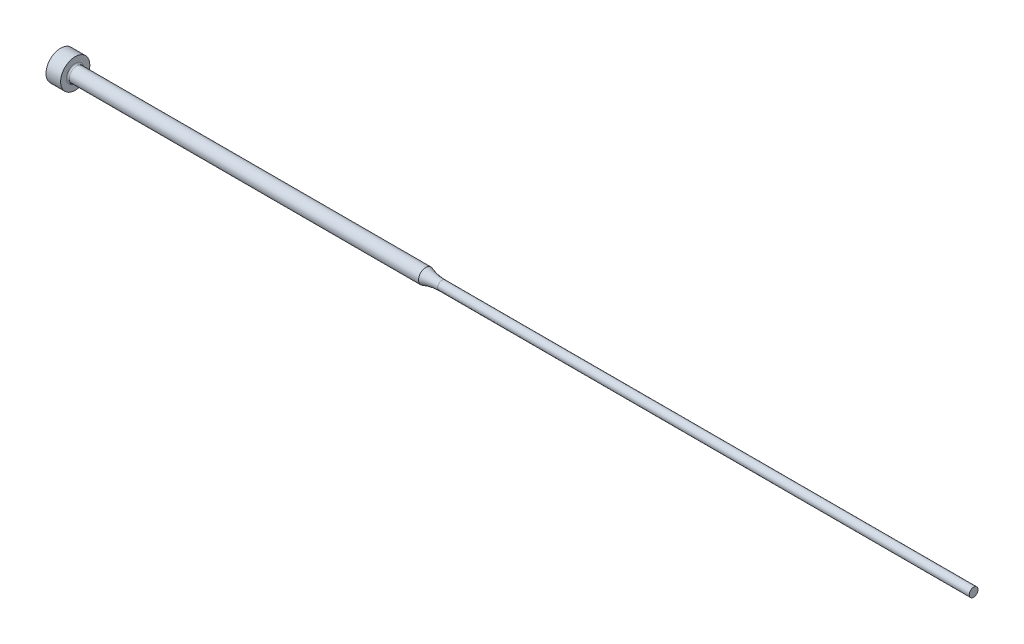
from build123d import *


with BuildPart() as part:
    # Sketch1 → Revolve1 (revolve)
    with BuildSketch(Plane.XY, mode=Mode.PRIVATE) as revolve1_sk:
        with BuildLine():
            Line((1.175, 1.18125), (1.175, 3.18125))
            Line((1.175, 3.18125), (3.175, 3.18125))
            Line((3.175, 3.18125), (3.175, 2.38125))
            ThreePointArc((3.175, 2.38125), (3.233578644, 2.239828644), (3.375, 2.18125))
            Line((3.375, 2.18125), (51.175, 2.18125))
            ThreePointArc((51.175, 2.18125), (52.266164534, 1.882050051), (53.393107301, 1.78125))
            Line((53.393107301, 1.78125), (126.175, 1.78125))
            Line((126.175, 1.78125), (126.175, 1.18125))
            Line((126.175, 1.18125), (1.175, 1.18125))
        make_face()
    revolve(revolve1_sk.sketch.rotate(Axis((126.175, 1.18125, 0), (-1, 0, 0)), 180), axis=Axis((126.175, 1.18125, 0), (-1, 0, 0)))


solid = part.part
